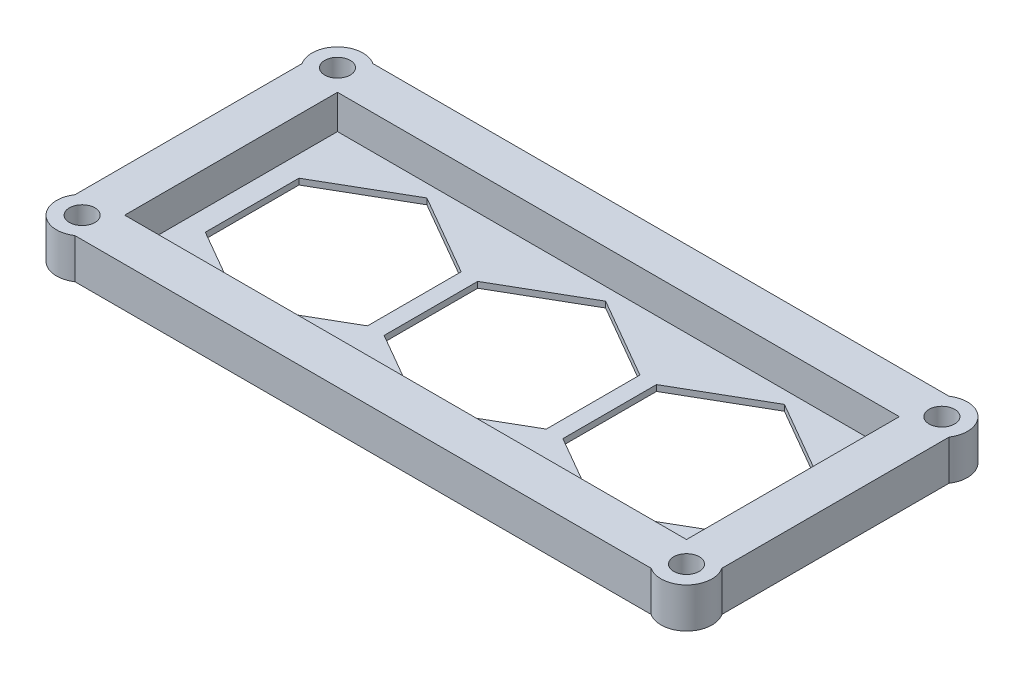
from build123d import *

# Parameters (mm, degrees)
ESBO_O1_R                = 1.5
RESSALTO_EXTRUS_O1_DEPTH = 0.7
ESBO_O2_R                = 1.5
ESBO_O2_W                = 66
ESBO_O2_H                = 25
RESSALTO_EXTRUS_O2_DEPTH = 4


with BuildPart() as part:
    # Esbo_o1 → Ressalto-extrus_o1 (new body)
    with BuildSketch(Plane(origin=(0, 0, 0), x_dir=(1, 0, 0), z_dir=(0, 1, 0))):
        with BuildLine():
            Line((-41.790364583, 19.050020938), (-41.790364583, -7.633354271))
            ThreePointArc((-41.790364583, -7.633354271), (-41.411684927, -11.41298701), (-37.632052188, -11.791666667))
            Line((-37.632052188, -11.791666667), (30.051323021, -11.791666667))
            ThreePointArc((30.051323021, -11.791666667), (33.83095576, -11.41298701), (34.209635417, -7.633354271))
            Line((34.209635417, -7.633354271), (34.209635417, 19.050020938))
            ThreePointArc((34.209635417, 19.050020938), (33.83095576, 22.829653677), (30.051323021, 23.208333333))
            Line((30.051323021, 23.208333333), (-37.632052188, 23.208333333))
            ThreePointArc((-37.632052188, 23.208333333), (-41.411684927, 22.829653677), (-41.790364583, 19.050020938))
        make_face()
        with Locations(Location((-39.290364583, 20.708333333, 0), (0, 0, 270))):
            Circle(ESBO_O1_R, mode=Mode.SUBTRACT)
        with Locations(Location((-39.290364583, -9.291666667, 0), (0, 0, 270))):
            Circle(ESBO_O1_R, mode=Mode.SUBTRACT)
        with Locations(Location((31.709635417, -9.291666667, 0), (0, 0, 270))):
            Circle(ESBO_O1_R, mode=Mode.SUBTRACT)
        with Locations(Location((31.709635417, 20.708333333, 0), (0, 0, 270))):
            Circle(ESBO_O1_R, mode=Mode.SUBTRACT)
        Polygon((17.209635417, 16.708333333), (7.683355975, 11.208333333), (7.683355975, 0.208333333), (17.209635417, -5.291666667), (26.735914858, 0.208333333), (26.735914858, 11.208333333), align=None, mode=Mode.SUBTRACT)
        Polygon((-3.790364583, 16.708333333), (-13.316644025, 11.208333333), (-13.316644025, 0.208333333), (-3.790364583, -5.291666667), (5.735914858, 0.208333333), (5.735914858, 11.208333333), align=None, mode=Mode.SUBTRACT)
        Polygon((-24.790364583, 16.708333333), (-34.316644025, 11.208333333), (-34.316644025, 0.208333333), (-24.790364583, -5.291666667), (-15.264085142, 0.208333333), (-15.264085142, 11.208333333), align=None, mode=Mode.SUBTRACT)
    extrude(amount=RESSALTO_EXTRUS_O1_DEPTH)

    # Esbo_o2 → Ressalto-extrus_o2 (add)
    with BuildSketch(Plane(origin=(0, 0.7, 0), x_dir=(1, 0, 0), z_dir=(0, 1, 0))):
        with BuildLine():
            Line((-41.790364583, 19.050020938), (-41.790364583, -7.633354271))
            ThreePointArc((-41.790364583, -7.633354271), (-41.411684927, -11.41298701), (-37.632052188, -11.791666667))
            Line((-37.632052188, -11.791666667), (30.051323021, -11.791666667))
            ThreePointArc((30.051323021, -11.791666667), (33.83095576, -11.41298701), (34.209635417, -7.633354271))
            Line((34.209635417, -7.633354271), (34.209635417, 19.050020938))
            ThreePointArc((34.209635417, 19.050020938), (33.83095576, 22.829653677), (30.051323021, 23.208333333))
            Line((30.051323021, 23.208333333), (-37.632052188, 23.208333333))
            ThreePointArc((-37.632052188, 23.208333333), (-41.411684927, 22.829653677), (-41.790364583, 19.050020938))
        make_face()
        with Locations(Location((-39.290364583, -9.291666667, 0), (0, 0, 270))):
            Circle(ESBO_O2_R, mode=Mode.SUBTRACT)
        with Locations(Location((-39.290364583, 20.708333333, 0), (0, 0, 270))):
            Circle(ESBO_O2_R, mode=Mode.SUBTRACT)
        with Locations(Location((31.709635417, 20.708333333, 0), (0, 0, 270))):
            Circle(ESBO_O2_R, mode=Mode.SUBTRACT)
        with Locations(Location((31.709635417, -9.291666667, 0), (0, 0, 270))):
            Circle(ESBO_O2_R, mode=Mode.SUBTRACT)
        with Locations((-3.790364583, 5.708333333)):
            Rectangle(ESBO_O2_W, ESBO_O2_H, mode=Mode.SUBTRACT)
    extrude(amount=RESSALTO_EXTRUS_O2_DEPTH)


solid = part.part
